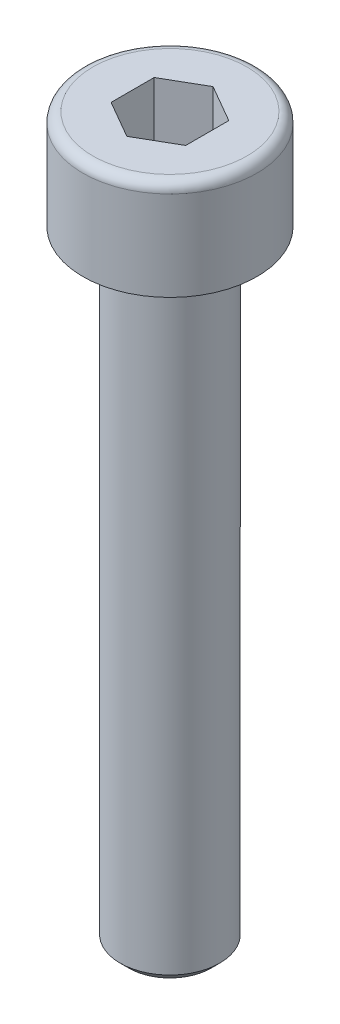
ISO-10303-21;
HEADER;
FILE_DESCRIPTION(('STEP AP214'),'2;1');
FILE_NAME('part.step','',(''),(''),'','','');
FILE_SCHEMA(('AUTOMOTIVE_DESIGN { 1 0 10303 214 1 1 1 1 }'));
ENDSEC;
DATA;
#1=APPLICATION_CONTEXT('core data for automotive mechanical design processes');
#2=APPLICATION_PROTOCOL_DEFINITION('international standard','automotive_design',2000,#1);
#3=PRODUCT_CONTEXT('',#1,'mechanical');
#4=PRODUCT('Part','Part','',(#3));
#5=PRODUCT_RELATED_PRODUCT_CATEGORY('part','',(#4));
#6=PRODUCT_DEFINITION_FORMATION('','',#4);
#7=PRODUCT_DEFINITION_CONTEXT('part definition',#1,'design');
#8=PRODUCT_DEFINITION('design','',#6,#7);
#9=PRODUCT_DEFINITION_SHAPE('','',#8);
#10=(LENGTH_UNIT() NAMED_UNIT(*) SI_UNIT(.MILLI.,.METRE.));
#11=(NAMED_UNIT(*) PLANE_ANGLE_UNIT() SI_UNIT($,.RADIAN.));
#12=(NAMED_UNIT(*) SI_UNIT($,.STERADIAN.) SOLID_ANGLE_UNIT());
#13=UNCERTAINTY_MEASURE_WITH_UNIT(LENGTH_MEASURE(1.E-05),#10,'distance_accuracy_value','');
#14=(GEOMETRIC_REPRESENTATION_CONTEXT(3) GLOBAL_UNCERTAINTY_ASSIGNED_CONTEXT((#13)) GLOBAL_UNIT_ASSIGNED_CONTEXT((#10,
#11,#12)) REPRESENTATION_CONTEXT('',''));
#15=CARTESIAN_POINT('',(0.,0.,0.));
#16=DIRECTION('',(0.,0.,1.));
#17=DIRECTION('',(1.,0.,0.));
#18=AXIS2_PLACEMENT_3D('',#15,#16,#17);
#19=CARTESIAN_POINT('',(2.00000000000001,-29.,0.));
#20=DIRECTION('',(0.,-1.,0.));
#21=DIRECTION('',(1.,0.,0.));
#22=AXIS2_PLACEMENT_3D('',#19,#20,#21);
#23=PLANE('',#22);
#24=CARTESIAN_POINT('',(0.,-29.,0.));
#25=DIRECTION('',(0.,-1.,0.));
#26=DIRECTION('',(1.,0.,0.));
#27=AXIS2_PLACEMENT_3D('',#24,#25,#26);
#28=CIRCLE('',#27,1.64999999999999);
#29=CARTESIAN_POINT('',(1.65,-29.,0.));
#30=VERTEX_POINT('',#29);
#31=EDGE_CURVE('E11',#30,#30,#28,.T.);
#32=ORIENTED_EDGE('',*,*,#31,.T.);
#33=EDGE_LOOP('',(#32));
#34=FACE_BOUND('',#33,.T.);
#35=ADVANCED_FACE('F30',(#34),#23,.T.);
#36=CARTESIAN_POINT('',(0.,65.1172922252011,0.));
#37=DIRECTION('',(0.,1.,0.));
#38=DIRECTION('',(-1.,0.,0.));
#39=AXIS2_PLACEMENT_3D('',#36,#37,#38);
#40=CYLINDRICAL_SURFACE('',#39,1.99999999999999);
#41=CARTESIAN_POINT('',(0.,-28.65,0.));
#42=DIRECTION('',(0.,-1.,0.));
#43=DIRECTION('',(1.,0.,0.));
#44=AXIS2_PLACEMENT_3D('',#41,#42,#43);
#45=CIRCLE('',#44,1.99999999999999);
#46=CARTESIAN_POINT('',(2.,-28.65,0.));
#47=VERTEX_POINT('',#46);
#48=EDGE_CURVE('E37',#47,#47,#45,.F.);
#49=ORIENTED_EDGE('',*,*,#48,.T.);
#50=EDGE_LOOP('',(#49));
#51=FACE_BOUND('',#50,.T.);
#52=CARTESIAN_POINT('',(0.,-4.,0.));
#53=DIRECTION('',(0.,1.,0.));
#54=DIRECTION('',(-1.,0.,0.));
#55=AXIS2_PLACEMENT_3D('',#52,#53,#54);
#56=CIRCLE('',#55,1.99999999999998);
#57=CARTESIAN_POINT('',(-1.99999999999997,-4.,0.));
#58=VERTEX_POINT('',#57);
#59=EDGE_CURVE('E145',#58,#58,#56,.T.);
#60=ORIENTED_EDGE('',*,*,#59,.F.);
#61=EDGE_LOOP('',(#60));
#62=FACE_BOUND('',#61,.T.);
#63=ADVANCED_FACE('F150',(#51,#62),#40,.T.);
#64=CARTESIAN_POINT('',(1.99999999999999,-4.,0.));
#65=DIRECTION('',(0.,1.,0.));
#66=DIRECTION('',(-1.,0.,0.));
#67=AXIS2_PLACEMENT_3D('',#64,#65,#66);
#68=PLANE('',#67);
#69=CARTESIAN_POINT('',(0.,-4.,0.));
#70=DIRECTION('',(0.,1.,0.));
#71=DIRECTION('',(-1.,0.,0.));
#72=AXIS2_PLACEMENT_3D('',#69,#70,#71);
#73=CIRCLE('',#72,3.49999999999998);
#74=CARTESIAN_POINT('',(-3.49999999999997,-4.,0.));
#75=VERTEX_POINT('',#74);
#76=EDGE_CURVE('E142',#75,#75,#73,.T.);
#77=ORIENTED_EDGE('',*,*,#76,.F.);
#78=EDGE_LOOP('',(#77));
#79=FACE_BOUND('',#78,.T.);
#80=ORIENTED_EDGE('',*,*,#59,.T.);
#81=EDGE_LOOP('',(#80));
#82=FACE_BOUND('',#81,.T.);
#83=ADVANCED_FACE('F174',(#79,#82),#68,.F.);
#84=CARTESIAN_POINT('',(0.,65.1172922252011,0.));
#85=DIRECTION('',(0.,1.,0.));
#86=DIRECTION('',(-1.,0.,0.));
#87=AXIS2_PLACEMENT_3D('',#84,#85,#86);
#88=CYLINDRICAL_SURFACE('',#87,3.49999999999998);
#89=CARTESIAN_POINT('',(0.,-0.399999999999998,0.));
#90=DIRECTION('',(0.,1.,0.));
#91=DIRECTION('',(-1.,0.,0.));
#92=AXIS2_PLACEMENT_3D('',#89,#90,#91);
#93=CIRCLE('',#92,3.49999999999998);
#94=CARTESIAN_POINT('',(-3.49999999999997,-0.399999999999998,0.));
#95=VERTEX_POINT('',#94);
#96=EDGE_CURVE('E139',#95,#95,#93,.T.);
#97=ORIENTED_EDGE('',*,*,#96,.F.);
#98=EDGE_LOOP('',(#97));
#99=FACE_BOUND('',#98,.T.);
#100=ORIENTED_EDGE('',*,*,#76,.T.);
#101=EDGE_LOOP('',(#100));
#102=FACE_BOUND('',#101,.T.);
#103=ADVANCED_FACE('F178',(#99,#102),#88,.T.);
#104=CARTESIAN_POINT('',(0.,-0.399999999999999,0.));
#105=DIRECTION('',(0.,1.,0.));
#106=DIRECTION('',(-1.,0.,0.));
#107=AXIS2_PLACEMENT_3D('',#104,#105,#106);
#108=TOROIDAL_SURFACE('',#107,3.09999999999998,0.4);
#109=CARTESIAN_POINT('',(0.,0.,0.));
#110=DIRECTION('',(0.,1.,0.));
#111=DIRECTION('',(-1.,0.,0.));
#112=AXIS2_PLACEMENT_3D('',#109,#110,#111);
#113=CIRCLE('',#112,3.09999999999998);
#114=CARTESIAN_POINT('',(-3.09999999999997,0.,0.));
#115=VERTEX_POINT('',#114);
#116=EDGE_CURVE('E130',#115,#115,#113,.T.);
#117=ORIENTED_EDGE('',*,*,#116,.F.);
#118=EDGE_LOOP('',(#117));
#119=FACE_BOUND('',#118,.T.);
#120=ORIENTED_EDGE('',*,*,#96,.T.);
#121=EDGE_LOOP('',(#120));
#122=FACE_BOUND('',#121,.T.);
#123=ADVANCED_FACE('F184',(#119,#122),#108,.T.);
#124=CARTESIAN_POINT('',(3.09999999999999,0.,0.));
#125=DIRECTION('',(0.,-1.,0.));
#126=DIRECTION('',(1.,0.,0.));
#127=AXIS2_PLACEMENT_3D('',#124,#125,#126);
#128=PLANE('',#127);
#129=DIRECTION('',(0.,0.,1.));
#130=VECTOR('',#129,1.);
#131=CARTESIAN_POINT('',(-1.5,0.,-0.866025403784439));
#132=LINE('',#131,#130);
#133=CARTESIAN_POINT('',(-1.5,0.,-0.866025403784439));
#134=VERTEX_POINT('',#133);
#135=CARTESIAN_POINT('',(-1.5,0.,0.866025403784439));
#136=VERTEX_POINT('',#135);
#137=EDGE_CURVE('E107',#134,#136,#132,.T.);
#138=ORIENTED_EDGE('',*,*,#137,.F.);
#139=DIRECTION('',(-0.866025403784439,0.,0.5));
#140=VECTOR('',#139,1.);
#141=CARTESIAN_POINT('',(0.,0.,-1.73205080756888));
#142=LINE('',#141,#140);
#143=CARTESIAN_POINT('',(0.,0.,-1.73205080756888));
#144=VERTEX_POINT('',#143);
#145=EDGE_CURVE('E44',#144,#134,#142,.T.);
#146=ORIENTED_EDGE('',*,*,#145,.F.);
#147=DIRECTION('',(0.866025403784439,0.,0.5));
#148=VECTOR('',#147,1.);
#149=CARTESIAN_POINT('',(0.,0.,-1.73205080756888));
#150=LINE('',#149,#148);
#151=CARTESIAN_POINT('',(1.5,0.,-0.866025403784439));
#152=VERTEX_POINT('',#151);
#153=EDGE_CURVE('E351',#144,#152,#150,.T.);
#154=ORIENTED_EDGE('',*,*,#153,.T.);
#155=DIRECTION('',(0.,0.,1.));
#156=VECTOR('',#155,1.);
#157=CARTESIAN_POINT('',(1.5,0.,-0.866025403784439));
#158=LINE('',#157,#156);
#159=CARTESIAN_POINT('',(1.5,0.,0.866025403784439));
#160=VERTEX_POINT('',#159);
#161=EDGE_CURVE('E348',#152,#160,#158,.T.);
#162=ORIENTED_EDGE('',*,*,#161,.T.);
#163=DIRECTION('',(-0.866025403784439,0.,0.5));
#164=VECTOR('',#163,1.);
#165=CARTESIAN_POINT('',(1.5,0.,0.866025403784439));
#166=LINE('',#165,#164);
#167=CARTESIAN_POINT('',(0.,0.,1.73205080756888));
#168=VERTEX_POINT('',#167);
#169=EDGE_CURVE('E345',#160,#168,#166,.T.);
#170=ORIENTED_EDGE('',*,*,#169,.T.);
#171=DIRECTION('',(0.866025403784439,0.,0.5));
#172=VECTOR('',#171,1.);
#173=CARTESIAN_POINT('',(-1.5,0.,0.866025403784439));
#174=LINE('',#173,#172);
#175=EDGE_CURVE('E343',#136,#168,#174,.T.);
#176=ORIENTED_EDGE('',*,*,#175,.F.);
#177=EDGE_LOOP('',(#138,#146,#154,#162,#170,#176));
#178=FACE_BOUND('',#177,.T.);
#179=ORIENTED_EDGE('',*,*,#116,.T.);
#180=EDGE_LOOP('',(#179));
#181=FACE_BOUND('',#180,.T.);
#182=ADVANCED_FACE('F188',(#178,#181),#128,.F.);
#183=CARTESIAN_POINT('',(0.,-2.88,-1.73205080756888));
#184=DIRECTION('',(-0.5,0.,-0.866025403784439));
#185=DIRECTION('',(-0.866025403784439,0.,0.5));
#186=AXIS2_PLACEMENT_3D('',#183,#184,#185);
#187=PLANE('',#186);
#188=ORIENTED_EDGE('',*,*,#145,.T.);
#189=DIRECTION('',(0.,1.,0.));
#190=VECTOR('',#189,1.);
#191=CARTESIAN_POINT('',(-1.5,-2.88,-0.866025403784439));
#192=LINE('',#191,#190);
#193=CARTESIAN_POINT('',(-1.5,-2.88,-0.866025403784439));
#194=VERTEX_POINT('',#193);
#195=EDGE_CURVE('E112',#194,#134,#192,.T.);
#196=ORIENTED_EDGE('',*,*,#195,.F.);
#197=DIRECTION('',(-0.866025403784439,0.,0.5));
#198=VECTOR('',#197,1.);
#199=CARTESIAN_POINT('',(0.,-2.88,-1.73205080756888));
#200=LINE('',#199,#198);
#201=CARTESIAN_POINT('',(0.,-2.88,-1.73205080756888));
#202=VERTEX_POINT('',#201);
#203=EDGE_CURVE('E101',#202,#194,#200,.T.);
#204=ORIENTED_EDGE('',*,*,#203,.F.);
#205=DIRECTION('',(0.,1.,0.));
#206=VECTOR('',#205,1.);
#207=CARTESIAN_POINT('',(0.,-2.88,-1.73205080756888));
#208=LINE('',#207,#206);
#209=EDGE_CURVE('E128',#202,#144,#208,.T.);
#210=ORIENTED_EDGE('',*,*,#209,.T.);
#211=EDGE_LOOP('',(#188,#196,#204,#210));
#212=FACE_BOUND('',#211,.T.);
#213=ADVANCED_FACE('F192',(#212),#187,.F.);
#214=CARTESIAN_POINT('',(0.,-2.88,-1.73205080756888));
#215=DIRECTION('',(-0.5,0.,0.866025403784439));
#216=DIRECTION('',(0.866025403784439,0.,0.5));
#217=AXIS2_PLACEMENT_3D('',#214,#215,#216);
#218=PLANE('',#217);
#219=ORIENTED_EDGE('',*,*,#153,.F.);
#220=ORIENTED_EDGE('',*,*,#209,.F.);
#221=DIRECTION('',(0.866025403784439,0.,0.5));
#222=VECTOR('',#221,1.);
#223=CARTESIAN_POINT('',(0.,-2.88,-1.73205080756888));
#224=LINE('',#223,#222);
#225=CARTESIAN_POINT('',(1.5,-2.88,-0.866025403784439));
#226=VERTEX_POINT('',#225);
#227=EDGE_CURVE('E125',#202,#226,#224,.T.);
#228=ORIENTED_EDGE('',*,*,#227,.T.);
#229=DIRECTION('',(0.,1.,0.));
#230=VECTOR('',#229,1.);
#231=CARTESIAN_POINT('',(1.5,-2.88,-0.866025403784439));
#232=LINE('',#231,#230);
#233=EDGE_CURVE('E131',#226,#152,#232,.T.);
#234=ORIENTED_EDGE('',*,*,#233,.T.);
#235=EDGE_LOOP('',(#219,#220,#228,#234));
#236=FACE_BOUND('',#235,.T.);
#237=ADVANCED_FACE('F196',(#236),#218,.T.);
#238=CARTESIAN_POINT('',(1.5,-2.88,-0.866025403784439));
#239=DIRECTION('',(-1.,0.,0.));
#240=DIRECTION('',(0.,-1.,0.));
#241=AXIS2_PLACEMENT_3D('',#238,#239,#240);
#242=PLANE('',#241);
#243=ORIENTED_EDGE('',*,*,#161,.F.);
#244=ORIENTED_EDGE('',*,*,#233,.F.);
#245=DIRECTION('',(0.,0.,1.));
#246=VECTOR('',#245,1.);
#247=CARTESIAN_POINT('',(1.5,-2.88,-0.866025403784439));
#248=LINE('',#247,#246);
#249=CARTESIAN_POINT('',(1.5,-2.88,0.866025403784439));
#250=VERTEX_POINT('',#249);
#251=EDGE_CURVE('E119',#226,#250,#248,.T.);
#252=ORIENTED_EDGE('',*,*,#251,.T.);
#253=DIRECTION('',(0.,1.,0.));
#254=VECTOR('',#253,1.);
#255=CARTESIAN_POINT('',(1.5,-2.88,0.866025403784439));
#256=LINE('',#255,#254);
#257=EDGE_CURVE('E133',#250,#160,#256,.T.);
#258=ORIENTED_EDGE('',*,*,#257,.T.);
#259=EDGE_LOOP('',(#243,#244,#252,#258));
#260=FACE_BOUND('',#259,.T.);
#261=ADVANCED_FACE('F204',(#260),#242,.T.);
#262=CARTESIAN_POINT('',(1.5,-2.88,0.866025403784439));
#263=DIRECTION('',(-0.5,0.,-0.866025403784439));
#264=DIRECTION('',(-0.866025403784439,0.,0.5));
#265=AXIS2_PLACEMENT_3D('',#262,#263,#264);
#266=PLANE('',#265);
#267=ORIENTED_EDGE('',*,*,#169,.F.);
#268=ORIENTED_EDGE('',*,*,#257,.F.);
#269=DIRECTION('',(-0.866025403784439,0.,0.5));
#270=VECTOR('',#269,1.);
#271=CARTESIAN_POINT('',(1.5,-2.88,0.866025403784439));
#272=LINE('',#271,#270);
#273=CARTESIAN_POINT('',(0.,-2.88,1.73205080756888));
#274=VERTEX_POINT('',#273);
#275=EDGE_CURVE('E116',#250,#274,#272,.T.);
#276=ORIENTED_EDGE('',*,*,#275,.T.);
#277=DIRECTION('',(0.,1.,0.));
#278=VECTOR('',#277,1.);
#279=CARTESIAN_POINT('',(0.,-2.88,1.73205080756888));
#280=LINE('',#279,#278);
#281=EDGE_CURVE('E111',#274,#168,#280,.T.);
#282=ORIENTED_EDGE('',*,*,#281,.T.);
#283=EDGE_LOOP('',(#267,#268,#276,#282));
#284=FACE_BOUND('',#283,.T.);
#285=ADVANCED_FACE('F201',(#284),#266,.T.);
#286=CARTESIAN_POINT('',(-1.5,-2.88,0.866025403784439));
#287=DIRECTION('',(-0.5,0.,0.866025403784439));
#288=DIRECTION('',(0.866025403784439,0.,0.5));
#289=AXIS2_PLACEMENT_3D('',#286,#287,#288);
#290=PLANE('',#289);
#291=ORIENTED_EDGE('',*,*,#175,.T.);
#292=ORIENTED_EDGE('',*,*,#281,.F.);
#293=DIRECTION('',(0.866025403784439,0.,0.5));
#294=VECTOR('',#293,1.);
#295=CARTESIAN_POINT('',(-1.5,-2.88,0.866025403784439));
#296=LINE('',#295,#294);
#297=CARTESIAN_POINT('',(-1.5,-2.88,0.866025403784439));
#298=VERTEX_POINT('',#297);
#299=EDGE_CURVE('E52',#298,#274,#296,.T.);
#300=ORIENTED_EDGE('',*,*,#299,.F.);
#301=DIRECTION('',(0.,1.,0.));
#302=VECTOR('',#301,1.);
#303=CARTESIAN_POINT('',(-1.5,-2.88,0.866025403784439));
#304=LINE('',#303,#302);
#305=EDGE_CURVE('E104',#298,#136,#304,.T.);
#306=ORIENTED_EDGE('',*,*,#305,.T.);
#307=EDGE_LOOP('',(#291,#292,#300,#306));
#308=FACE_BOUND('',#307,.T.);
#309=ADVANCED_FACE('F115',(#308),#290,.F.);
#310=CARTESIAN_POINT('',(-1.5,-2.88,-0.866025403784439));
#311=DIRECTION('',(-1.,0.,0.));
#312=DIRECTION('',(0.,-1.,0.));
#313=AXIS2_PLACEMENT_3D('',#310,#311,#312);
#314=PLANE('',#313);
#315=ORIENTED_EDGE('',*,*,#137,.T.);
#316=ORIENTED_EDGE('',*,*,#305,.F.);
#317=DIRECTION('',(0.,0.,1.));
#318=VECTOR('',#317,1.);
#319=CARTESIAN_POINT('',(-1.5,-2.88,-0.866025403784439));
#320=LINE('',#319,#318);
#321=EDGE_CURVE('E94',#194,#298,#320,.T.);
#322=ORIENTED_EDGE('',*,*,#321,.F.);
#323=ORIENTED_EDGE('',*,*,#195,.T.);
#324=EDGE_LOOP('',(#315,#316,#322,#323));
#325=FACE_BOUND('',#324,.T.);
#326=ADVANCED_FACE('F105',(#325),#314,.F.);
#327=CARTESIAN_POINT('',(-1.5,-2.88,-0.866025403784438));
#328=DIRECTION('',(0.104319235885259,0.977992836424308,0.180686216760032));
#329=DIRECTION('',(0.,-0.181677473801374,0.983358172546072));
#330=AXIS2_PLACEMENT_3D('',#327,#328,#329);
#331=PLANE('',#330);
#332=DIRECTION('',(-0.85161315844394,0.181677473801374,-0.491679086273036));
#333=VECTOR('',#332,1.);
#334=CARTESIAN_POINT('',(0.,-3.2,0.));
#335=LINE('',#334,#333);
#336=CARTESIAN_POINT('',(0.,-3.2,0.));
#337=VERTEX_POINT('',#336);
#338=EDGE_CURVE('E98',#337,#194,#335,.T.);
#339=ORIENTED_EDGE('',*,*,#338,.F.);
#340=DIRECTION('',(0.,0.181677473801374,-0.983358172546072));
#341=VECTOR('',#340,1.);
#342=CARTESIAN_POINT('',(0.,-3.2,0.));
#343=LINE('',#342,#341);
#344=EDGE_CURVE('E336',#337,#202,#343,.T.);
#345=ORIENTED_EDGE('',*,*,#344,.T.);
#346=ORIENTED_EDGE('',*,*,#203,.T.);
#347=EDGE_LOOP('',(#339,#345,#346));
#348=FACE_BOUND('',#347,.T.);
#349=ADVANCED_FACE('F158',(#348),#331,.T.);
#350=CARTESIAN_POINT('',(0.,-2.88,-1.73205080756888));
#351=DIRECTION('',(-0.10431923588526,0.977992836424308,0.180686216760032));
#352=DIRECTION('',(0.,-0.181677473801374,0.983358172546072));
#353=AXIS2_PLACEMENT_3D('',#350,#351,#352);
#354=PLANE('',#353);
#355=ORIENTED_EDGE('',*,*,#344,.F.);
#356=DIRECTION('',(0.85161315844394,0.181677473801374,-0.491679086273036));
#357=VECTOR('',#356,1.);
#358=CARTESIAN_POINT('',(0.,-3.2,0.));
#359=LINE('',#358,#357);
#360=EDGE_CURVE('E90',#337,#226,#359,.T.);
#361=ORIENTED_EDGE('',*,*,#360,.T.);
#362=ORIENTED_EDGE('',*,*,#227,.F.);
#363=EDGE_LOOP('',(#355,#361,#362));
#364=FACE_BOUND('',#363,.T.);
#365=ADVANCED_FACE('F166',(#364),#354,.T.);
#366=CARTESIAN_POINT('',(-1.5,-2.88,0.866025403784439));
#367=DIRECTION('',(0.208638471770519,0.977992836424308,0.));
#368=DIRECTION('',(-0.977992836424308,0.208638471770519,0.));
#369=AXIS2_PLACEMENT_3D('',#366,#367,#368);
#370=PLANE('',#369);
#371=DIRECTION('',(-0.85161315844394,0.181677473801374,0.491679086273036));
#372=VECTOR('',#371,1.);
#373=CARTESIAN_POINT('',(0.,-3.2,0.));
#374=LINE('',#373,#372);
#375=EDGE_CURVE('E84',#337,#298,#374,.T.);
#376=ORIENTED_EDGE('',*,*,#375,.F.);
#377=ORIENTED_EDGE('',*,*,#338,.T.);
#378=ORIENTED_EDGE('',*,*,#321,.T.);
#379=EDGE_LOOP('',(#376,#377,#378));
#380=FACE_BOUND('',#379,.T.);
#381=ADVANCED_FACE('F96',(#380),#370,.T.);
#382=CARTESIAN_POINT('',(1.5,-2.88,-0.866025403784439));
#383=DIRECTION('',(-0.208638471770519,0.977992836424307,0.));
#384=DIRECTION('',(-0.977992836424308,-0.208638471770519,0.));
#385=AXIS2_PLACEMENT_3D('',#382,#383,#384);
#386=PLANE('',#385);
#387=ORIENTED_EDGE('',*,*,#360,.F.);
#388=DIRECTION('',(0.85161315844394,0.181677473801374,0.491679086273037));
#389=VECTOR('',#388,1.);
#390=CARTESIAN_POINT('',(0.,-3.2,0.));
#391=LINE('',#390,#389);
#392=EDGE_CURVE('E91',#337,#250,#391,.T.);
#393=ORIENTED_EDGE('',*,*,#392,.T.);
#394=ORIENTED_EDGE('',*,*,#251,.F.);
#395=EDGE_LOOP('',(#387,#393,#394));
#396=FACE_BOUND('',#395,.T.);
#397=ADVANCED_FACE('F217',(#396),#386,.T.);
#398=CARTESIAN_POINT('',(0.,-2.88,1.73205080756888));
#399=DIRECTION('',(0.104319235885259,0.977992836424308,-0.180686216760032));
#400=DIRECTION('',(0.,0.181677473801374,0.983358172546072));
#401=AXIS2_PLACEMENT_3D('',#398,#399,#400);
#402=PLANE('',#401);
#403=DIRECTION('',(0.,0.181677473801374,0.983358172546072));
#404=VECTOR('',#403,1.);
#405=CARTESIAN_POINT('',(0.,-3.2,0.));
#406=LINE('',#405,#404);
#407=EDGE_CURVE('E87',#337,#274,#406,.T.);
#408=ORIENTED_EDGE('',*,*,#407,.F.);
#409=ORIENTED_EDGE('',*,*,#375,.T.);
#410=ORIENTED_EDGE('',*,*,#299,.T.);
#411=EDGE_LOOP('',(#408,#409,#410));
#412=FACE_BOUND('',#411,.T.);
#413=ADVANCED_FACE('F86',(#412),#402,.T.);
#414=CARTESIAN_POINT('',(1.5,-2.88,0.866025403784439));
#415=DIRECTION('',(-0.104319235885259,0.977992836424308,-0.180686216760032));
#416=DIRECTION('',(0.,0.181677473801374,0.983358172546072));
#417=AXIS2_PLACEMENT_3D('',#414,#415,#416);
#418=PLANE('',#417);
#419=ORIENTED_EDGE('',*,*,#392,.F.);
#420=ORIENTED_EDGE('',*,*,#407,.T.);
#421=ORIENTED_EDGE('',*,*,#275,.F.);
#422=EDGE_LOOP('',(#419,#420,#421));
#423=FACE_BOUND('',#422,.T.);
#424=ADVANCED_FACE('F155',(#423),#418,.T.);
#425=CARTESIAN_POINT('',(0.,-28.65,0.));
#426=DIRECTION('',(0.,1.,0.));
#427=DIRECTION('',(-1.,0.,0.));
#428=AXIS2_PLACEMENT_3D('',#425,#426,#427);
#429=CONICAL_SURFACE('',#428,1.99999999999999,0.785398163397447);
#430=ORIENTED_EDGE('',*,*,#31,.F.);
#431=EDGE_LOOP('',(#430));
#432=FACE_BOUND('',#431,.T.);
#433=ORIENTED_EDGE('',*,*,#48,.F.);
#434=EDGE_LOOP('',(#433));
#435=FACE_BOUND('',#434,.T.);
#436=ADVANCED_FACE('F153',(#432,#435),#429,.T.);
#437=CLOSED_SHELL('',(#35,#63,#83,#103,#123,#182,#213,#237,#261,#285,#309,#326,#349,#365,#381,
#397,#413,#424,#436));
#438=MANIFOLD_SOLID_BREP('B2',#437);
#439=ADVANCED_BREP_SHAPE_REPRESENTATION('',(#18,#438),#14);
#440=SHAPE_DEFINITION_REPRESENTATION(#9,#439);
ENDSEC;
END-ISO-10303-21;
